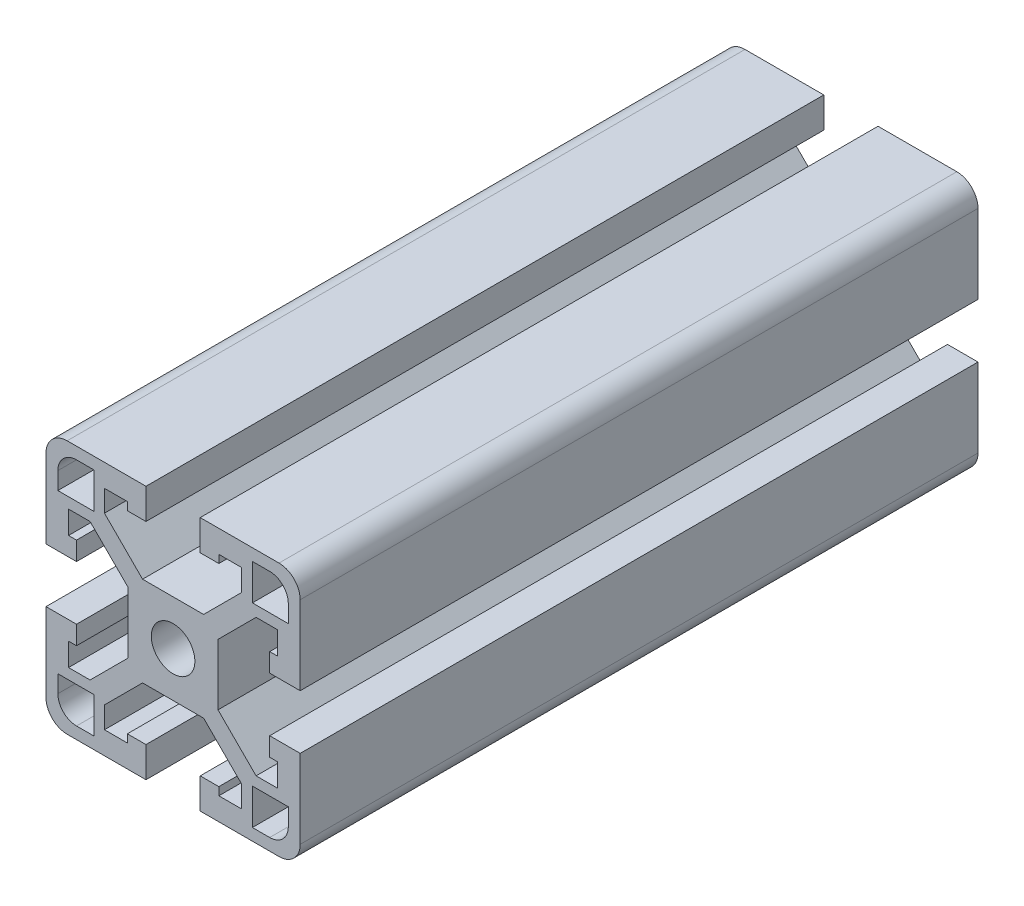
from build123d import *

# Parameters (mm, degrees)
SKETCH1_R           = 3.2639
BOSS_EXTRUDE1_DEPTH = 50.8


with BuildPart() as part:
    # Sketch1 → Boss-Extrude1 (new, symmetric)
    with BuildSketch(Plane.XY):
        with BuildLine():
            Line((-6.731, 4.575738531), (-6.731, -4.575738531))
            Line((-6.731, -4.575738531), (-12.442261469, -10.287))
            Line((-12.442261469, -10.287), (-15.6718, -10.287))
            Line((-15.6718, -10.287), (-15.6718, -6.858))
            Line((-15.6718, -6.858), (-14.478, -6.858))
            Line((-14.478, -6.858), (-14.478, -4.064))
            Line((-14.478, -4.064), (-19.05, -4.064))
            Line((-19.05, -4.064), (-19.05, -15.875))
            ThreePointArc((-19.05, -15.875), (-18.12006403, -18.12006403), (-15.875, -19.05))
            Line((-15.875, -19.05), (-4.064, -19.05))
            Line((-4.064, -19.05), (-4.064, -14.478))
            Line((-4.064, -14.478), (-6.858, -14.478))
            Line((-6.858, -14.478), (-6.858, -15.6718))
            Line((-6.858, -15.6718), (-10.287, -15.6718))
            Line((-10.287, -15.6718), (-10.287, -12.442261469))
            Line((-10.287, -12.442261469), (-4.575738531, -6.731))
            Line((-4.575738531, -6.731), (4.575738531, -6.731))
            Line((4.575738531, -6.731), (10.287, -12.442261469))
            Line((10.287, -12.442261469), (10.287, -15.6718))
            Line((10.287, -15.6718), (6.858, -15.6718))
            Line((6.858, -15.6718), (6.858, -14.478))
            Line((6.858, -14.478), (4.064, -14.478))
            Line((4.064, -14.478), (4.064, -19.05))
            Line((4.064, -19.05), (15.875, -19.05))
            ThreePointArc((15.875, -19.05), (18.12006403, -18.12006403), (19.05, -15.875))
            Line((19.05, -15.875), (19.05, -4.064))
            Line((19.05, -4.064), (14.478, -4.064))
            Line((14.478, -4.064), (14.478, -6.858))
            Line((14.478, -6.858), (15.6718, -6.858))
            Line((15.6718, -6.858), (15.6718, -10.287))
            Line((15.6718, -10.287), (12.442261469, -10.287))
            Line((12.442261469, -10.287), (6.731, -4.575738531))
            Line((6.731, -4.575738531), (6.731, 4.575738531))
            Line((6.731, 4.575738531), (12.442261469, 10.287))
            Line((12.442261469, 10.287), (15.6718, 10.287))
            Line((15.6718, 10.287), (15.6718, 6.858))
            Line((15.6718, 6.858), (14.478, 6.858))
            Line((14.478, 6.858), (14.478, 4.064))
            Line((14.478, 4.064), (19.05, 4.064))
            Line((19.05, 4.064), (19.05, 15.875))
            ThreePointArc((19.05, 15.875), (18.12006403, 18.12006403), (15.875, 19.05))
            Line((15.875, 19.05), (4.064, 19.05))
            Line((4.064, 19.05), (4.064, 14.478))
            Line((4.064, 14.478), (6.858, 14.478))
            Line((6.858, 14.478), (6.858, 15.6718))
            Line((6.858, 15.6718), (10.287, 15.6718))
            Line((10.287, 15.6718), (10.287, 12.442261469))
            Line((10.287, 12.442261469), (4.575738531, 6.731))
            Line((4.575738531, 6.731), (-4.575738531, 6.731))
            Line((-4.575738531, 6.731), (-10.287, 12.442261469))
            Line((-10.287, 12.442261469), (-10.287, 15.6718))
            Line((-10.287, 15.6718), (-6.858, 15.6718))
            Line((-6.858, 15.6718), (-6.858, 14.478))
            Line((-6.858, 14.478), (-4.064, 14.478))
            Line((-4.064, 14.478), (-4.064, 19.05))
            Line((-4.064, 19.05), (-15.875, 19.05))
            ThreePointArc((-15.875, 19.05), (-18.12006403, 18.12006403), (-19.05, 15.875))
            Line((-19.05, 15.875), (-19.05, 4.064))
            Line((-19.05, 4.064), (-14.478, 4.064))
            Line((-14.478, 4.064), (-14.478, 6.858))
            Line((-14.478, 6.858), (-15.6718, 6.858))
            Line((-15.6718, 6.858), (-15.6718, 10.287))
            Line((-15.6718, 10.287), (-12.442261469, 10.287))
            Line((-12.442261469, 10.287), (-6.731, 4.575738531))
        make_face()
        Circle(SKETCH1_R, mode=Mode.SUBTRACT)
        with BuildLine():
            Line((-11.8872, 17.272), (-14.478, 17.272))
            ThreePointArc((-14.478, 17.272), (-16.453656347, 16.453656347), (-17.272, 14.478))
            Line((-17.272, 14.478), (-17.272, 11.8872))
            Line((-17.272, 11.8872), (-11.8872, 11.8872))
            Line((-11.8872, 11.8872), (-11.8872, 17.272))
        make_face(mode=Mode.SUBTRACT)
        with BuildLine():
            Line((14.478, 17.272), (11.8872, 17.272))
            Line((11.8872, 17.272), (11.8872, 11.8872))
            Line((11.8872, 11.8872), (17.272, 11.8872))
            Line((17.272, 11.8872), (17.272, 14.478))
            ThreePointArc((17.272, 14.478), (16.453656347, 16.453656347), (14.478, 17.272))
        make_face(mode=Mode.SUBTRACT)
        with BuildLine():
            Line((11.8872, -17.272), (14.478, -17.272))
            ThreePointArc((14.478, -17.272), (16.453656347, -16.453656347), (17.272, -14.478))
            Line((17.272, -14.478), (17.272, -11.8872))
            Line((17.272, -11.8872), (11.8872, -11.8872))
            Line((11.8872, -11.8872), (11.8872, -17.272))
        make_face(mode=Mode.SUBTRACT)
        with BuildLine():
            Line((-14.478, -17.272), (-11.8872, -17.272))
            Line((-11.8872, -17.272), (-11.8872, -11.8872))
            Line((-11.8872, -11.8872), (-17.272, -11.8872))
            Line((-17.272, -11.8872), (-17.272, -14.478))
            ThreePointArc((-17.272, -14.478), (-16.453656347, -16.453656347), (-14.478, -17.272))
        make_face(mode=Mode.SUBTRACT)
    extrude(amount=BOSS_EXTRUDE1_DEPTH, both=True)


solid = part.part
